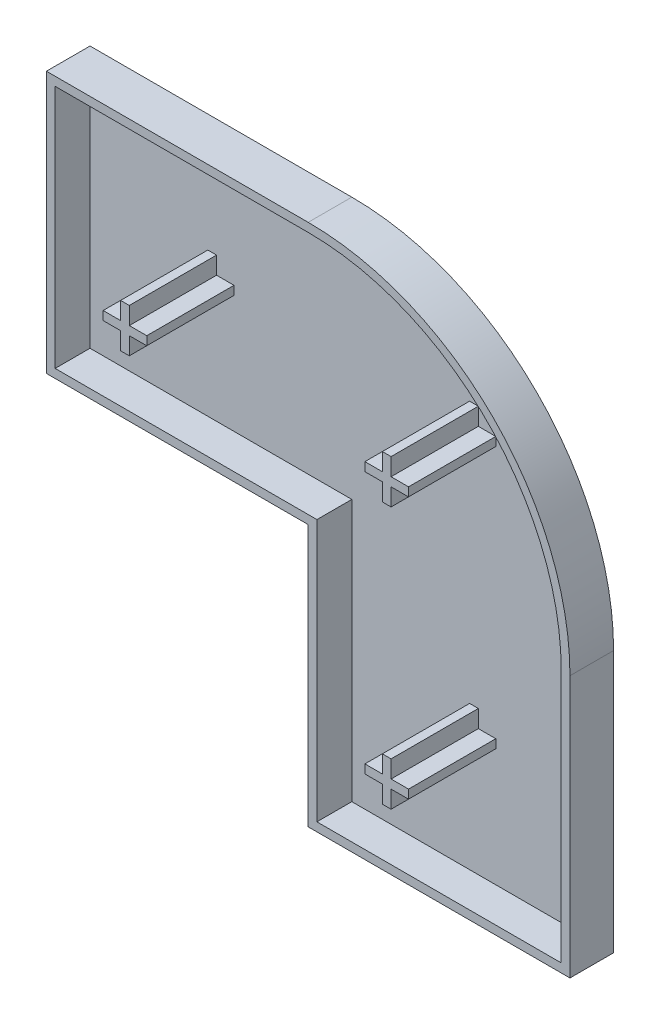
from build123d import *

# Parameters (mm, degrees)
EXTRUDE_1_DEPTH = 2.5
SHELL_1_T       = -1
EXTRUDE_2_DEPTH = 10


with BuildPart() as part:
    # Sketch 1 → Extrude 1 (new, symmetric)
    with BuildSketch(Plane.XY):
        with BuildLine():
            Line((-30, 30), (0, 30))
            ThreePointArc((0, 30), (21.213203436, 21.213203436), (30, 0))
            Line((30, 0), (30, -30))
            Line((30, -30), (0, -30))
            Line((0, -30), (0, 0))
            Line((0, 0), (-30, 0))
            Line((-30, 0), (-30, 30))
        make_face()
    extrude(amount=EXTRUDE_1_DEPTH, both=True)

    # Shell 1
    shell_1_openings = [part.faces().sort_by_distance(p)[0] for p in [
        (3.590150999, 3.590150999, 2.5),
    ]]
    offset(amount=SHELL_1_T, openings=shell_1_openings, kind=Kind.INTERSECTION)

    # Sketch 2 → Extrude 2 (add)
    with BuildSketch(Plane.XY.offset(-1.5)):
        Polygon((15.5, 15.5), (17.5, 15.5), (17.5, 14.5), (15.5, 14.5), (15.5, 12.5), (14.5, 12.5), (14.5, 14.5), (12.5, 14.5), (12.5, 15.5), (14.5, 15.5), (14.5, 17.5), (15.5, 17.5), align=None)
        Polygon((-12.5, 15.5), (-12.5, 14.5), (-14.5, 14.5), (-14.5, 12.5), (-15.5, 12.5), (-15.5, 14.5), (-17.5, 14.5), (-17.5, 15.5), (-15.5, 15.5), (-15.5, 17.5), (-14.5, 17.5), (-14.5, 15.5), align=None)
        Polygon((14.5, -14.5), (14.5, -12.5), (15.5, -12.5), (15.5, -14.5), (17.5, -14.5), (17.5, -15.5), (15.5, -15.5), (15.5, -17.5), (14.5, -17.5), (14.5, -15.5), (12.5, -15.5), (12.5, -14.5), align=None)
    extrude(amount=EXTRUDE_2_DEPTH)


solid = part.part
